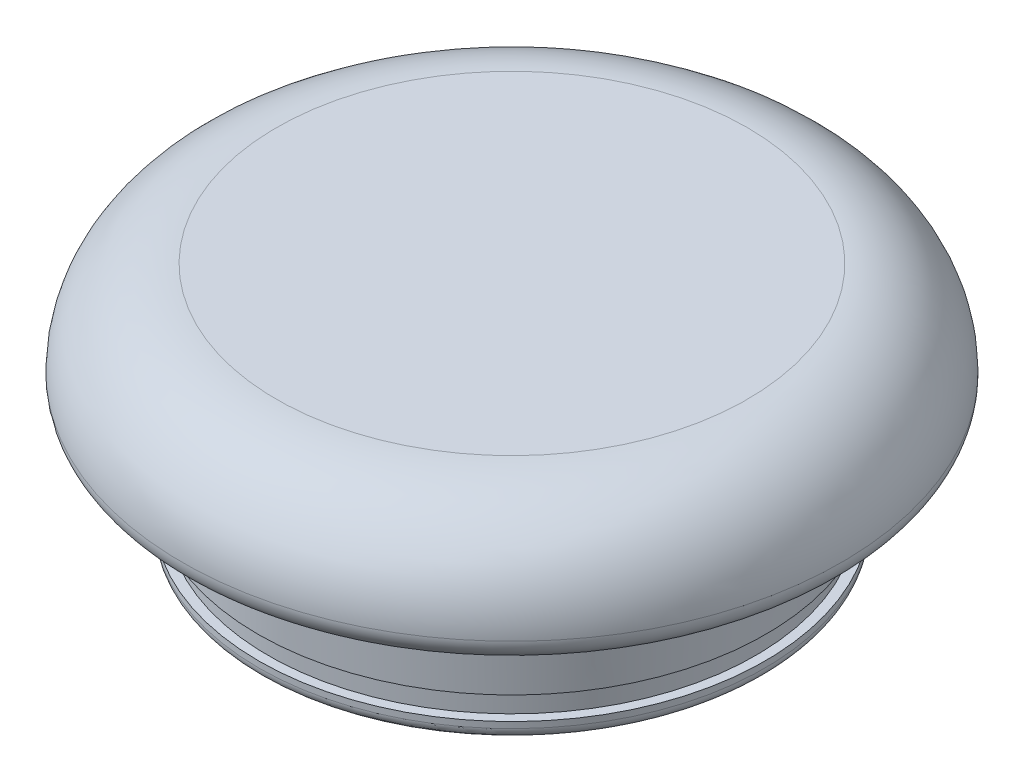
ISO-10303-21;
HEADER;
FILE_DESCRIPTION(('STEP AP214'),'2;1');
FILE_NAME('part.step','',(''),(''),'','','');
FILE_SCHEMA(('AUTOMOTIVE_DESIGN { 1 0 10303 214 1 1 1 1 }'));
ENDSEC;
DATA;
#1=APPLICATION_CONTEXT('core data for automotive mechanical design processes');
#2=APPLICATION_PROTOCOL_DEFINITION('international standard','automotive_design',2000,#1);
#3=PRODUCT_CONTEXT('',#1,'mechanical');
#4=PRODUCT('Part','Part','',(#3));
#5=PRODUCT_RELATED_PRODUCT_CATEGORY('part','',(#4));
#6=PRODUCT_DEFINITION_FORMATION('','',#4);
#7=PRODUCT_DEFINITION_CONTEXT('part definition',#1,'design');
#8=PRODUCT_DEFINITION('design','',#6,#7);
#9=PRODUCT_DEFINITION_SHAPE('','',#8);
#10=(LENGTH_UNIT() NAMED_UNIT(*) SI_UNIT(.MILLI.,.METRE.));
#11=(NAMED_UNIT(*) PLANE_ANGLE_UNIT() SI_UNIT($,.RADIAN.));
#12=(NAMED_UNIT(*) SI_UNIT($,.STERADIAN.) SOLID_ANGLE_UNIT());
#13=UNCERTAINTY_MEASURE_WITH_UNIT(LENGTH_MEASURE(1.E-05),#10,'distance_accuracy_value','');
#14=(GEOMETRIC_REPRESENTATION_CONTEXT(3) GLOBAL_UNCERTAINTY_ASSIGNED_CONTEXT((#13)) GLOBAL_UNIT_ASSIGNED_CONTEXT((#10,
#11,#12)) REPRESENTATION_CONTEXT('',''));
#15=CARTESIAN_POINT('',(0.,0.,0.));
#16=DIRECTION('',(0.,0.,1.));
#17=DIRECTION('',(1.,0.,0.));
#18=AXIS2_PLACEMENT_3D('',#15,#16,#17);
#19=CARTESIAN_POINT('',(-26.0160814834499,-25.4,0.));
#20=DIRECTION('',(0.,1.,0.));
#21=DIRECTION('',(0.,0.,1.));
#22=AXIS2_PLACEMENT_3D('',#19,#20,#21);
#23=PLANE('',#22);
#24=CARTESIAN_POINT('',(0.,-25.4,0.));
#25=DIRECTION('',(0.,-1.,0.));
#26=DIRECTION('',(0.,0.,-1.));
#27=AXIS2_PLACEMENT_3D('',#24,#25,#26);
#28=CIRCLE('',#27,23.876);
#29=CARTESIAN_POINT('',(0.,-25.4,-23.876));
#30=VERTEX_POINT('',#29);
#31=EDGE_CURVE('E50',#30,#30,#28,.T.);
#32=ORIENTED_EDGE('',*,*,#31,.F.);
#33=EDGE_LOOP('',(#32));
#34=FACE_BOUND('',#33,.T.);
#35=CARTESIAN_POINT('',(0.,-25.4,0.));
#36=DIRECTION('',(0.,-1.,0.));
#37=DIRECTION('',(0.,0.,-1.));
#38=AXIS2_PLACEMENT_3D('',#35,#36,#37);
#39=CIRCLE('',#38,26.0160814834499);
#40=CARTESIAN_POINT('',(0.,-25.4,-26.0160814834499));
#41=VERTEX_POINT('',#40);
#42=EDGE_CURVE('E77',#41,#41,#39,.T.);
#43=ORIENTED_EDGE('',*,*,#42,.T.);
#44=EDGE_LOOP('',(#43));
#45=FACE_BOUND('',#44,.T.);
#46=ADVANCED_FACE('F30',(#34,#45),#23,.F.);
#47=CARTESIAN_POINT('',(0.,-25.4,0.));
#48=DIRECTION('',(0.,-1.,0.));
#49=DIRECTION('',(0.,0.,-1.));
#50=AXIS2_PLACEMENT_3D('',#47,#48,#49);
#51=CONICAL_SURFACE('',#50,23.876,0.0349065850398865);
#52=CARTESIAN_POINT('',(0.,-3.91483881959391,0.));
#53=DIRECTION('',(0.,-1.,0.));
#54=DIRECTION('',(0.,0.,-1.));
#55=AXIS2_PLACEMENT_3D('',#52,#53,#54);
#56=CIRCLE('',#55,23.125721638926);
#57=CARTESIAN_POINT('',(0.,-3.91483881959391,-23.125721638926));
#58=VERTEX_POINT('',#57);
#59=EDGE_CURVE('E10',#58,#58,#56,.F.);
#60=ORIENTED_EDGE('',*,*,#59,.T.);
#61=EDGE_LOOP('',(#60));
#62=FACE_BOUND('',#61,.T.);
#63=ORIENTED_EDGE('',*,*,#31,.T.);
#64=EDGE_LOOP('',(#63));
#65=FACE_BOUND('',#64,.T.);
#66=ADVANCED_FACE('F97',(#62,#65),#51,.F.);
#67=CARTESIAN_POINT('',(-23.1043208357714,-3.302,0.));
#68=DIRECTION('',(0.,1.,0.));
#69=DIRECTION('',(0.,0.,1.));
#70=AXIS2_PLACEMENT_3D('',#67,#68,#69);
#71=PLANE('',#70);
#72=CARTESIAN_POINT('',(0.,-3.302,0.));
#73=DIRECTION('',(0.,1.,0.));
#74=DIRECTION('',(0.,0.,1.));
#75=AXIS2_PLACEMENT_3D('',#72,#73,#74);
#76=CIRCLE('',#75,22.4911084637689);
#77=CARTESIAN_POINT('',(0.,-3.302,22.4911084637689));
#78=VERTEX_POINT('',#77);
#79=EDGE_CURVE('E37',#78,#78,#76,.F.);
#80=ORIENTED_EDGE('',*,*,#79,.T.);
#81=EDGE_LOOP('',(#80));
#82=FACE_BOUND('',#81,.T.);
#83=ADVANCED_FACE('F103',(#82),#71,.F.);
#84=CARTESIAN_POINT('',(0.,0.,0.));
#85=DIRECTION('',(0.,-1.,0.));
#86=DIRECTION('',(0.,0.,-1.));
#87=AXIS2_PLACEMENT_3D('',#84,#85,#86);
#88=PLANE('',#87);
#89=CARTESIAN_POINT('',(0.,0.,0.));
#90=DIRECTION('',(0.,-1.,0.));
#91=DIRECTION('',(0.,0.,-1.));
#92=AXIS2_PLACEMENT_3D('',#89,#90,#91);
#93=CIRCLE('',#92,25.4);
#94=CARTESIAN_POINT('',(0.,0.,-25.4));
#95=VERTEX_POINT('',#94);
#96=EDGE_CURVE('E53',#95,#95,#93,.T.);
#97=ORIENTED_EDGE('',*,*,#96,.F.);
#98=EDGE_LOOP('',(#97));
#99=FACE_BOUND('',#98,.T.);
#100=ADVANCED_FACE('F109',(#99),#88,.F.);
#101=CARTESIAN_POINT('',(0.,-10.16,0.));
#102=DIRECTION('',(0.,-1.,0.));
#103=DIRECTION('',(0.,0.,-1.));
#104=AXIS2_PLACEMENT_3D('',#101,#102,#103);
#105=TOROIDAL_SURFACE('',#104,25.4,10.16);
#106=CARTESIAN_POINT('',(0.,-10.16,0.));
#107=DIRECTION('',(0.,-1.,0.));
#108=DIRECTION('',(0.,0.,-1.));
#109=AXIS2_PLACEMENT_3D('',#106,#107,#108);
#110=CIRCLE('',#109,35.56);
#111=CARTESIAN_POINT('',(0.,-10.16,-35.56));
#112=VERTEX_POINT('',#111);
#113=EDGE_CURVE('E56',#112,#112,#110,.T.);
#114=ORIENTED_EDGE('',*,*,#113,.F.);
#115=EDGE_LOOP('',(#114));
#116=FACE_BOUND('',#115,.T.);
#117=ORIENTED_EDGE('',*,*,#96,.T.);
#118=EDGE_LOOP('',(#117));
#119=FACE_BOUND('',#118,.T.);
#120=ADVANCED_FACE('F112',(#116,#119),#105,.T.);
#121=CARTESIAN_POINT('',(0.,-10.16,0.));
#122=DIRECTION('',(0.,-1.,0.));
#123=DIRECTION('',(0.,0.,-1.));
#124=AXIS2_PLACEMENT_3D('',#121,#122,#123);
#125=TOROIDAL_SURFACE('',#124,33.02,2.54);
#126=CARTESIAN_POINT('',(0.,-12.7,0.));
#127=DIRECTION('',(0.,-1.,0.));
#128=DIRECTION('',(0.,0.,-1.));
#129=AXIS2_PLACEMENT_3D('',#126,#127,#128);
#130=CIRCLE('',#129,33.02);
#131=CARTESIAN_POINT('',(0.,-12.7,-33.02));
#132=VERTEX_POINT('',#131);
#133=EDGE_CURVE('E59',#132,#132,#130,.T.);
#134=ORIENTED_EDGE('',*,*,#133,.F.);
#135=EDGE_LOOP('',(#134));
#136=FACE_BOUND('',#135,.T.);
#137=ORIENTED_EDGE('',*,*,#113,.T.);
#138=EDGE_LOOP('',(#137));
#139=FACE_BOUND('',#138,.T.);
#140=ADVANCED_FACE('F116',(#136,#139),#125,.T.);
#141=CARTESIAN_POINT('',(-33.02,-12.7,0.));
#142=DIRECTION('',(0.,1.,0.));
#143=DIRECTION('',(0.,0.,1.));
#144=AXIS2_PLACEMENT_3D('',#141,#142,#143);
#145=PLANE('',#144);
#146=CARTESIAN_POINT('',(0.,-12.7,0.));
#147=DIRECTION('',(0.,1.,0.));
#148=DIRECTION('',(0.,0.,1.));
#149=AXIS2_PLACEMENT_3D('',#146,#147,#148);
#150=CIRCLE('',#149,28.2992123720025);
#151=CARTESIAN_POINT('',(0.,-12.7,28.2992123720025));
#152=VERTEX_POINT('',#151);
#153=EDGE_CURVE('E41',#152,#152,#150,.T.);
#154=ORIENTED_EDGE('',*,*,#153,.T.);
#155=EDGE_LOOP('',(#154));
#156=FACE_BOUND('',#155,.T.);
#157=ORIENTED_EDGE('',*,*,#133,.T.);
#158=EDGE_LOOP('',(#157));
#159=FACE_BOUND('',#158,.T.);
#160=ADVANCED_FACE('F120',(#156,#159),#145,.F.);
#161=CARTESIAN_POINT('',(0.,-12.7,0.));
#162=DIRECTION('',(0.,1.,0.));
#163=DIRECTION('',(0.,0.,1.));
#164=AXIS2_PLACEMENT_3D('',#161,#162,#163);
#165=CONICAL_SURFACE('',#164,27.686,0.0349065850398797);
#166=CARTESIAN_POINT('',(0.,-13.3128388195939,0.));
#167=DIRECTION('',(0.,1.,0.));
#168=DIRECTION('',(0.,0.,1.));
#169=AXIS2_PLACEMENT_3D('',#166,#167,#168);
#170=CIRCLE('',#169,27.6645991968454);
#171=CARTESIAN_POINT('',(0.,-13.3128388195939,27.6645991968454));
#172=VERTEX_POINT('',#171);
#173=EDGE_CURVE('E45',#172,#172,#170,.F.);
#174=ORIENTED_EDGE('',*,*,#173,.T.);
#175=EDGE_LOOP('',(#174));
#176=FACE_BOUND('',#175,.T.);
#177=CARTESIAN_POINT('',(0.,-20.955,0.));
#178=DIRECTION('',(0.,-1.,0.));
#179=DIRECTION('',(0.,0.,-1.));
#180=AXIS2_PLACEMENT_3D('',#177,#178,#179);
#181=CIRCLE('',#180,27.3977290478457);
#182=CARTESIAN_POINT('',(0.,-20.955,-27.3977290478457));
#183=VERTEX_POINT('',#182);
#184=EDGE_CURVE('E62',#183,#183,#181,.T.);
#185=ORIENTED_EDGE('',*,*,#184,.F.);
#186=EDGE_LOOP('',(#185));
#187=FACE_BOUND('',#186,.T.);
#188=ADVANCED_FACE('F124',(#176,#187),#165,.T.);
#189=CARTESIAN_POINT('',(-27.3977290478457,-20.955,0.));
#190=DIRECTION('',(0.,1.,0.));
#191=DIRECTION('',(0.,0.,1.));
#192=AXIS2_PLACEMENT_3D('',#189,#190,#191);
#193=PLANE('',#192);
#194=CARTESIAN_POINT('',(0.,-20.955,0.));
#195=DIRECTION('',(0.,-1.,0.));
#196=DIRECTION('',(0.,0.,-1.));
#197=AXIS2_PLACEMENT_3D('',#194,#195,#196);
#198=CIRCLE('',#197,26.3811097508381);
#199=CARTESIAN_POINT('',(0.,-20.955,-26.3811097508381));
#200=VERTEX_POINT('',#199);
#201=EDGE_CURVE('E65',#200,#200,#198,.T.);
#202=ORIENTED_EDGE('',*,*,#201,.F.);
#203=EDGE_LOOP('',(#202));
#204=FACE_BOUND('',#203,.T.);
#205=ORIENTED_EDGE('',*,*,#184,.T.);
#206=EDGE_LOOP('',(#205));
#207=FACE_BOUND('',#206,.T.);
#208=ADVANCED_FACE('F128',(#204,#207),#193,.F.);
#209=CARTESIAN_POINT('',(0.,-23.495,0.));
#210=DIRECTION('',(0.,1.,0.));
#211=DIRECTION('',(0.,0.,1.));
#212=AXIS2_PLACEMENT_3D('',#209,#210,#211);
#213=CONICAL_SURFACE('',#212,26.2924109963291,0.0349065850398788);
#214=ORIENTED_EDGE('',*,*,#201,.T.);
#215=EDGE_LOOP('',(#214));
#216=FACE_BOUND('',#215,.T.);
#217=CARTESIAN_POINT('',(0.,-23.495,0.));
#218=DIRECTION('',(0.,-1.,0.));
#219=DIRECTION('',(0.,0.,-1.));
#220=AXIS2_PLACEMENT_3D('',#217,#218,#219);
#221=CIRCLE('',#220,26.2924109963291);
#222=CARTESIAN_POINT('',(0.,-23.495,-26.2924109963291));
#223=VERTEX_POINT('',#222);
#224=EDGE_CURVE('E68',#223,#223,#221,.T.);
#225=ORIENTED_EDGE('',*,*,#224,.F.);
#226=EDGE_LOOP('',(#225));
#227=FACE_BOUND('',#226,.T.);
#228=ADVANCED_FACE('F132',(#216,#227),#213,.T.);
#229=CARTESIAN_POINT('',(-26.2924109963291,-23.495,0.));
#230=DIRECTION('',(0.,-1.,0.));
#231=DIRECTION('',(0.,0.,-1.));
#232=AXIS2_PLACEMENT_3D('',#229,#230,#231);
#233=PLANE('',#232);
#234=CARTESIAN_POINT('',(0.,-23.495,0.));
#235=DIRECTION('',(0.,-1.,0.));
#236=DIRECTION('',(0.,0.,-1.));
#237=AXIS2_PLACEMENT_3D('',#234,#235,#236);
#238=CIRCLE('',#237,27.3090302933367);
#239=CARTESIAN_POINT('',(0.,-23.495,-27.3090302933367));
#240=VERTEX_POINT('',#239);
#241=EDGE_CURVE('E71',#240,#240,#238,.T.);
#242=ORIENTED_EDGE('',*,*,#241,.F.);
#243=EDGE_LOOP('',(#242));
#244=FACE_BOUND('',#243,.T.);
#245=ORIENTED_EDGE('',*,*,#224,.T.);
#246=EDGE_LOOP('',(#245));
#247=FACE_BOUND('',#246,.T.);
#248=ADVANCED_FACE('F93',(#244,#247),#233,.F.);
#249=CARTESIAN_POINT('',(0.,-23.495,0.));
#250=DIRECTION('',(0.,1.,0.));
#251=DIRECTION('',(0.,0.,1.));
#252=AXIS2_PLACEMENT_3D('',#249,#250,#251);
#253=CONICAL_SURFACE('',#252,27.3090302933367,0.0349065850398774);
#254=CARTESIAN_POINT('',(0.,-24.1743223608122,0.));
#255=DIRECTION('',(0.,-1.,0.));
#256=DIRECTION('',(0.,0.,-1.));
#257=AXIS2_PLACEMENT_3D('',#254,#255,#256);
#258=CIRCLE('',#257,27.2853078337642);
#259=CARTESIAN_POINT('',(0.,-24.1743223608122,-27.2853078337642));
#260=VERTEX_POINT('',#259);
#261=EDGE_CURVE('E74',#260,#260,#258,.T.);
#262=ORIENTED_EDGE('',*,*,#261,.F.);
#263=EDGE_LOOP('',(#262));
#264=FACE_BOUND('',#263,.T.);
#265=ORIENTED_EDGE('',*,*,#241,.T.);
#266=EDGE_LOOP('',(#265));
#267=FACE_BOUND('',#266,.T.);
#268=ADVANCED_FACE('F85',(#264,#267),#253,.T.);
#269=CARTESIAN_POINT('',(0.,-24.13,0.));
#270=DIRECTION('',(0.,-1.,0.));
#271=DIRECTION('',(0.,0.,-1.));
#272=AXIS2_PLACEMENT_3D('',#269,#270,#271);
#273=TOROIDAL_SURFACE('',#272,26.0160814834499,1.27);
#274=ORIENTED_EDGE('',*,*,#261,.T.);
#275=EDGE_LOOP('',(#274));
#276=FACE_BOUND('',#275,.T.);
#277=ORIENTED_EDGE('',*,*,#42,.F.);
#278=EDGE_LOOP('',(#277));
#279=FACE_BOUND('',#278,.T.);
#280=ADVANCED_FACE('F82',(#276,#279),#273,.T.);
#281=CARTESIAN_POINT('',(0.,-13.335,0.));
#282=DIRECTION('',(0.,1.,0.));
#283=DIRECTION('',(0.,0.,1.));
#284=AXIS2_PLACEMENT_3D('',#281,#282,#283);
#285=TOROIDAL_SURFACE('',#284,28.2992123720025,0.635);
#286=ORIENTED_EDGE('',*,*,#153,.F.);
#287=EDGE_LOOP('',(#286));
#288=FACE_BOUND('',#287,.T.);
#289=ORIENTED_EDGE('',*,*,#173,.F.);
#290=EDGE_LOOP('',(#289));
#291=FACE_BOUND('',#290,.T.);
#292=ADVANCED_FACE('F84',(#288,#291),#285,.F.);
#293=CARTESIAN_POINT('',(0.,-3.937,0.));
#294=DIRECTION('',(0.,1.,0.));
#295=DIRECTION('',(0.,0.,1.));
#296=AXIS2_PLACEMENT_3D('',#293,#294,#295);
#297=TOROIDAL_SURFACE('',#296,22.4911084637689,0.635);
#298=ORIENTED_EDGE('',*,*,#59,.F.);
#299=EDGE_LOOP('',(#298));
#300=FACE_BOUND('',#299,.T.);
#301=ORIENTED_EDGE('',*,*,#79,.F.);
#302=EDGE_LOOP('',(#301));
#303=FACE_BOUND('',#302,.T.);
#304=ADVANCED_FACE('F32',(#300,#303),#297,.F.);
#305=CLOSED_SHELL('',(#46,#66,#83,#100,#120,#140,#160,#188,#208,#228,#248,#268,#280,#292,#304));
#306=MANIFOLD_SOLID_BREP('B2',#305);
#307=ADVANCED_BREP_SHAPE_REPRESENTATION('',(#18,#306),#14);
#308=SHAPE_DEFINITION_REPRESENTATION(#9,#307);
ENDSEC;
END-ISO-10303-21;
